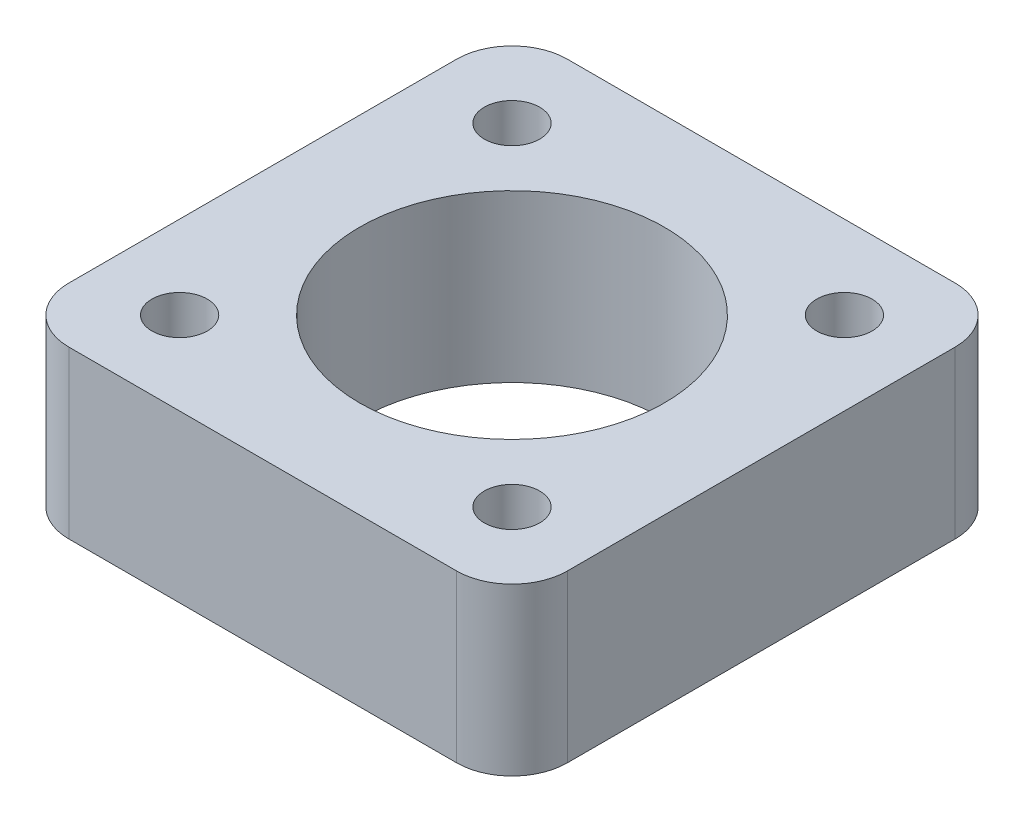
ISO-10303-21;
HEADER;
FILE_DESCRIPTION(('STEP AP214'),'2;1');
FILE_NAME('part.step','',(''),(''),'','','');
FILE_SCHEMA(('AUTOMOTIVE_DESIGN { 1 0 10303 214 1 1 1 1 }'));
ENDSEC;
DATA;
#1=APPLICATION_CONTEXT('core data for automotive mechanical design processes');
#2=APPLICATION_PROTOCOL_DEFINITION('international standard','automotive_design',2000,#1);
#3=PRODUCT_CONTEXT('',#1,'mechanical');
#4=PRODUCT('Part','Part','',(#3));
#5=PRODUCT_RELATED_PRODUCT_CATEGORY('part','',(#4));
#6=PRODUCT_DEFINITION_FORMATION('','',#4);
#7=PRODUCT_DEFINITION_CONTEXT('part definition',#1,'design');
#8=PRODUCT_DEFINITION('design','',#6,#7);
#9=PRODUCT_DEFINITION_SHAPE('','',#8);
#10=(LENGTH_UNIT() NAMED_UNIT(*) SI_UNIT(.MILLI.,.METRE.));
#11=(NAMED_UNIT(*) PLANE_ANGLE_UNIT() SI_UNIT($,.RADIAN.));
#12=(NAMED_UNIT(*) SI_UNIT($,.STERADIAN.) SOLID_ANGLE_UNIT());
#13=UNCERTAINTY_MEASURE_WITH_UNIT(LENGTH_MEASURE(1.E-05),#10,'distance_accuracy_value','');
#14=(GEOMETRIC_REPRESENTATION_CONTEXT(3) GLOBAL_UNCERTAINTY_ASSIGNED_CONTEXT((#13)) GLOBAL_UNIT_ASSIGNED_CONTEXT((#10,
#11,#12)) REPRESENTATION_CONTEXT('',''));
#15=CARTESIAN_POINT('',(0.,0.,0.));
#16=DIRECTION('',(0.,0.,1.));
#17=DIRECTION('',(1.,0.,0.));
#18=AXIS2_PLACEMENT_3D('',#15,#16,#17);
#19=CARTESIAN_POINT('',(0.,12.,0.));
#20=DIRECTION('',(1.,0.,0.));
#21=DIRECTION('',(0.,0.,-1.));
#22=AXIS2_PLACEMENT_3D('',#19,#20,#21);
#23=PLANE('',#22);
#24=DIRECTION('',(0.,0.,1.));
#25=VECTOR('',#24,1.);
#26=CARTESIAN_POINT('',(0.,12.,0.));
#27=LINE('',#26,#25);
#28=CARTESIAN_POINT('',(0.,12.,-32.));
#29=VERTEX_POINT('',#28);
#30=CARTESIAN_POINT('',(0.,12.,-4.));
#31=VERTEX_POINT('',#30);
#32=EDGE_CURVE('E125',#29,#31,#27,.T.);
#33=ORIENTED_EDGE('',*,*,#32,.F.);
#34=DIRECTION('',(0.,-1.,0.));
#35=VECTOR('',#34,1.);
#36=CARTESIAN_POINT('',(0.,12.,-32.));
#37=LINE('',#36,#35);
#38=CARTESIAN_POINT('',(0.,0.,-32.));
#39=VERTEX_POINT('',#38);
#40=EDGE_CURVE('E11',#29,#39,#37,.T.);
#41=ORIENTED_EDGE('',*,*,#40,.T.);
#42=DIRECTION('',(0.,0.,1.));
#43=VECTOR('',#42,1.);
#44=CARTESIAN_POINT('',(0.,0.,0.));
#45=LINE('',#44,#43);
#46=CARTESIAN_POINT('',(0.,0.,-4.));
#47=VERTEX_POINT('',#46);
#48=EDGE_CURVE('E127',#39,#47,#45,.T.);
#49=ORIENTED_EDGE('',*,*,#48,.T.);
#50=DIRECTION('',(0.,-1.,0.));
#51=VECTOR('',#50,1.);
#52=CARTESIAN_POINT('',(0.,12.,-4.));
#53=LINE('',#52,#51);
#54=EDGE_CURVE('E38',#47,#31,#53,.F.);
#55=ORIENTED_EDGE('',*,*,#54,.T.);
#56=EDGE_LOOP('',(#33,#41,#49,#55));
#57=FACE_BOUND('',#56,.T.);
#58=ADVANCED_FACE('F31',(#57),#23,.F.);
#59=CARTESIAN_POINT('',(0.,12.,0.));
#60=DIRECTION('',(0.,0.,-1.));
#61=DIRECTION('',(-1.,0.,0.));
#62=AXIS2_PLACEMENT_3D('',#59,#60,#61);
#63=PLANE('',#62);
#64=DIRECTION('',(1.,0.,0.));
#65=VECTOR('',#64,1.);
#66=CARTESIAN_POINT('',(0.,0.,0.));
#67=LINE('',#66,#65);
#68=CARTESIAN_POINT('',(4.,0.,0.));
#69=VERTEX_POINT('',#68);
#70=CARTESIAN_POINT('',(32.,0.,0.));
#71=VERTEX_POINT('',#70);
#72=EDGE_CURVE('E123',#69,#71,#67,.T.);
#73=ORIENTED_EDGE('',*,*,#72,.T.);
#74=DIRECTION('',(0.,-1.,0.));
#75=VECTOR('',#74,1.);
#76=CARTESIAN_POINT('',(32.,12.,0.));
#77=LINE('',#76,#75);
#78=CARTESIAN_POINT('',(32.,12.,0.));
#79=VERTEX_POINT('',#78);
#80=EDGE_CURVE('E102',#71,#79,#77,.F.);
#81=ORIENTED_EDGE('',*,*,#80,.T.);
#82=DIRECTION('',(1.,0.,0.));
#83=VECTOR('',#82,1.);
#84=CARTESIAN_POINT('',(0.,12.,0.));
#85=LINE('',#84,#83);
#86=CARTESIAN_POINT('',(4.,12.,0.));
#87=VERTEX_POINT('',#86);
#88=EDGE_CURVE('E133',#87,#79,#85,.T.);
#89=ORIENTED_EDGE('',*,*,#88,.F.);
#90=DIRECTION('',(0.,-1.,0.));
#91=VECTOR('',#90,1.);
#92=CARTESIAN_POINT('',(4.,12.,0.));
#93=LINE('',#92,#91);
#94=EDGE_CURVE('E107',#87,#69,#93,.T.);
#95=ORIENTED_EDGE('',*,*,#94,.T.);
#96=EDGE_LOOP('',(#73,#81,#89,#95));
#97=FACE_BOUND('',#96,.T.);
#98=ADVANCED_FACE('F171',(#97),#63,.F.);
#99=CARTESIAN_POINT('',(36.,12.,0.));
#100=DIRECTION('',(-1.,0.,0.));
#101=DIRECTION('',(0.,0.,1.));
#102=AXIS2_PLACEMENT_3D('',#99,#100,#101);
#103=PLANE('',#102);
#104=DIRECTION('',(0.,0.,-1.));
#105=VECTOR('',#104,1.);
#106=CARTESIAN_POINT('',(36.,12.,0.));
#107=LINE('',#106,#105);
#108=CARTESIAN_POINT('',(36.,12.,-4.));
#109=VERTEX_POINT('',#108);
#110=CARTESIAN_POINT('',(36.,12.,-32.));
#111=VERTEX_POINT('',#110);
#112=EDGE_CURVE('E116',#109,#111,#107,.T.);
#113=ORIENTED_EDGE('',*,*,#112,.F.);
#114=DIRECTION('',(0.,-1.,0.));
#115=VECTOR('',#114,1.);
#116=CARTESIAN_POINT('',(36.,12.,-4.));
#117=LINE('',#116,#115);
#118=CARTESIAN_POINT('',(36.,0.,-4.));
#119=VERTEX_POINT('',#118);
#120=EDGE_CURVE('E101',#109,#119,#117,.T.);
#121=ORIENTED_EDGE('',*,*,#120,.T.);
#122=DIRECTION('',(0.,0.,-1.));
#123=VECTOR('',#122,1.);
#124=CARTESIAN_POINT('',(36.,0.,0.));
#125=LINE('',#124,#123);
#126=CARTESIAN_POINT('',(36.,0.,-32.));
#127=VERTEX_POINT('',#126);
#128=EDGE_CURVE('E114',#119,#127,#125,.T.);
#129=ORIENTED_EDGE('',*,*,#128,.T.);
#130=DIRECTION('',(0.,-1.,0.));
#131=VECTOR('',#130,1.);
#132=CARTESIAN_POINT('',(36.,12.,-32.));
#133=LINE('',#132,#131);
#134=EDGE_CURVE('E118',#127,#111,#133,.F.);
#135=ORIENTED_EDGE('',*,*,#134,.T.);
#136=EDGE_LOOP('',(#113,#121,#129,#135));
#137=FACE_BOUND('',#136,.T.);
#138=ADVANCED_FACE('F113',(#137),#103,.F.);
#139=CARTESIAN_POINT('',(0.,12.,-36.));
#140=DIRECTION('',(0.,0.,1.));
#141=DIRECTION('',(1.,0.,0.));
#142=AXIS2_PLACEMENT_3D('',#139,#140,#141);
#143=PLANE('',#142);
#144=DIRECTION('',(-1.,0.,0.));
#145=VECTOR('',#144,1.);
#146=CARTESIAN_POINT('',(0.,12.,-36.));
#147=LINE('',#146,#145);
#148=CARTESIAN_POINT('',(32.,12.,-36.));
#149=VERTEX_POINT('',#148);
#150=CARTESIAN_POINT('',(4.,12.,-36.));
#151=VERTEX_POINT('',#150);
#152=EDGE_CURVE('E137',#149,#151,#147,.T.);
#153=ORIENTED_EDGE('',*,*,#152,.F.);
#154=DIRECTION('',(0.,-1.,0.));
#155=VECTOR('',#154,1.);
#156=CARTESIAN_POINT('',(32.,12.,-36.));
#157=LINE('',#156,#155);
#158=CARTESIAN_POINT('',(32.,0.,-36.));
#159=VERTEX_POINT('',#158);
#160=EDGE_CURVE('E155',#149,#159,#157,.T.);
#161=ORIENTED_EDGE('',*,*,#160,.T.);
#162=DIRECTION('',(-1.,0.,0.));
#163=VECTOR('',#162,1.);
#164=CARTESIAN_POINT('',(0.,0.,-36.));
#165=LINE('',#164,#163);
#166=CARTESIAN_POINT('',(4.,0.,-36.));
#167=VERTEX_POINT('',#166);
#168=EDGE_CURVE('E122',#159,#167,#165,.T.);
#169=ORIENTED_EDGE('',*,*,#168,.T.);
#170=DIRECTION('',(0.,-1.,0.));
#171=VECTOR('',#170,1.);
#172=CARTESIAN_POINT('',(4.,12.,-36.));
#173=LINE('',#172,#171);
#174=EDGE_CURVE('E45',#167,#151,#173,.F.);
#175=ORIENTED_EDGE('',*,*,#174,.T.);
#176=EDGE_LOOP('',(#153,#161,#169,#175));
#177=FACE_BOUND('',#176,.T.);
#178=ADVANCED_FACE('F208',(#177),#143,.F.);
#179=CARTESIAN_POINT('',(0.,12.,-36.));
#180=DIRECTION('',(0.,-1.,0.));
#181=DIRECTION('',(0.,0.,-1.));
#182=AXIS2_PLACEMENT_3D('',#179,#180,#181);
#183=PLANE('',#182);
#184=CARTESIAN_POINT('',(30.,12.,-5.99999999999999));
#185=DIRECTION('',(0.,1.,0.));
#186=DIRECTION('',(0.,0.,1.));
#187=AXIS2_PLACEMENT_3D('',#184,#185,#186);
#188=CIRCLE('',#187,2.);
#189=CARTESIAN_POINT('',(30.,12.,-3.99999999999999));
#190=VERTEX_POINT('',#189);
#191=EDGE_CURVE('E200',#190,#190,#188,.T.);
#192=ORIENTED_EDGE('',*,*,#191,.F.);
#193=EDGE_LOOP('',(#192));
#194=FACE_BOUND('',#193,.T.);
#195=CARTESIAN_POINT('',(30.,12.,-30.));
#196=DIRECTION('',(0.,1.,0.));
#197=DIRECTION('',(0.,0.,1.));
#198=AXIS2_PLACEMENT_3D('',#195,#196,#197);
#199=CIRCLE('',#198,2.);
#200=CARTESIAN_POINT('',(30.,12.,-28.));
#201=VERTEX_POINT('',#200);
#202=EDGE_CURVE('E194',#201,#201,#199,.T.);
#203=ORIENTED_EDGE('',*,*,#202,.F.);
#204=EDGE_LOOP('',(#203));
#205=FACE_BOUND('',#204,.T.);
#206=CARTESIAN_POINT('',(6.,12.,-5.99999999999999));
#207=DIRECTION('',(0.,1.,0.));
#208=DIRECTION('',(0.,0.,1.));
#209=AXIS2_PLACEMENT_3D('',#206,#207,#208);
#210=CIRCLE('',#209,2.);
#211=CARTESIAN_POINT('',(6.,12.,-3.99999999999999));
#212=VERTEX_POINT('',#211);
#213=EDGE_CURVE('E188',#212,#212,#210,.T.);
#214=ORIENTED_EDGE('',*,*,#213,.F.);
#215=EDGE_LOOP('',(#214));
#216=FACE_BOUND('',#215,.T.);
#217=CARTESIAN_POINT('',(6.,12.,-30.));
#218=DIRECTION('',(0.,1.,0.));
#219=DIRECTION('',(0.,0.,1.));
#220=AXIS2_PLACEMENT_3D('',#217,#218,#219);
#221=CIRCLE('',#220,2.);
#222=CARTESIAN_POINT('',(6.,12.,-28.));
#223=VERTEX_POINT('',#222);
#224=EDGE_CURVE('E182',#223,#223,#221,.T.);
#225=ORIENTED_EDGE('',*,*,#224,.F.);
#226=EDGE_LOOP('',(#225));
#227=FACE_BOUND('',#226,.T.);
#228=CARTESIAN_POINT('',(18.,12.,-18.));
#229=DIRECTION('',(0.,1.,0.));
#230=DIRECTION('',(0.,0.,1.));
#231=AXIS2_PLACEMENT_3D('',#228,#229,#230);
#232=CIRCLE('',#231,11.);
#233=CARTESIAN_POINT('',(18.,12.,-7.));
#234=VERTEX_POINT('',#233);
#235=EDGE_CURVE('E174',#234,#234,#232,.T.);
#236=ORIENTED_EDGE('',*,*,#235,.F.);
#237=EDGE_LOOP('',(#236));
#238=FACE_BOUND('',#237,.T.);
#239=ORIENTED_EDGE('',*,*,#88,.T.);
#240=CARTESIAN_POINT('',(32.,12.,-4.));
#241=DIRECTION('',(0.,-1.,0.));
#242=DIRECTION('',(0.,0.,-1.));
#243=AXIS2_PLACEMENT_3D('',#240,#241,#242);
#244=CIRCLE('',#243,4.);
#245=EDGE_CURVE('E152',#79,#109,#244,.F.);
#246=ORIENTED_EDGE('',*,*,#245,.T.);
#247=ORIENTED_EDGE('',*,*,#112,.T.);
#248=CARTESIAN_POINT('',(32.,12.,-32.));
#249=DIRECTION('',(0.,-1.,0.));
#250=DIRECTION('',(0.,0.,-1.));
#251=AXIS2_PLACEMENT_3D('',#248,#249,#250);
#252=CIRCLE('',#251,4.);
#253=EDGE_CURVE('E52',#111,#149,#252,.F.);
#254=ORIENTED_EDGE('',*,*,#253,.T.);
#255=ORIENTED_EDGE('',*,*,#152,.T.);
#256=CARTESIAN_POINT('',(4.,12.,-32.));
#257=DIRECTION('',(0.,-1.,0.));
#258=DIRECTION('',(0.,0.,-1.));
#259=AXIS2_PLACEMENT_3D('',#256,#257,#258);
#260=CIRCLE('',#259,4.);
#261=EDGE_CURVE('E149',#151,#29,#260,.F.);
#262=ORIENTED_EDGE('',*,*,#261,.T.);
#263=ORIENTED_EDGE('',*,*,#32,.T.);
#264=CARTESIAN_POINT('',(4.,12.,-4.));
#265=DIRECTION('',(0.,-1.,0.));
#266=DIRECTION('',(0.,0.,-1.));
#267=AXIS2_PLACEMENT_3D('',#264,#265,#266);
#268=CIRCLE('',#267,4.);
#269=EDGE_CURVE('E147',#31,#87,#268,.F.);
#270=ORIENTED_EDGE('',*,*,#269,.T.);
#271=EDGE_LOOP('',(#239,#246,#247,#254,#255,#262,#263,#270));
#272=FACE_BOUND('',#271,.T.);
#273=ADVANCED_FACE('F165',(#194,#205,#216,#227,#238,#272),#183,.F.);
#274=CARTESIAN_POINT('',(0.,0.,-36.));
#275=DIRECTION('',(0.,-1.,0.));
#276=DIRECTION('',(0.,0.,-1.));
#277=AXIS2_PLACEMENT_3D('',#274,#275,#276);
#278=PLANE('',#277);
#279=CARTESIAN_POINT('',(30.,0.,-5.99999999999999));
#280=DIRECTION('',(0.,1.,0.));
#281=DIRECTION('',(0.,0.,1.));
#282=AXIS2_PLACEMENT_3D('',#279,#280,#281);
#283=CIRCLE('',#282,2.);
#284=CARTESIAN_POINT('',(30.,0.,-3.99999999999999));
#285=VERTEX_POINT('',#284);
#286=EDGE_CURVE('E197',#285,#285,#283,.T.);
#287=ORIENTED_EDGE('',*,*,#286,.T.);
#288=EDGE_LOOP('',(#287));
#289=FACE_BOUND('',#288,.T.);
#290=CARTESIAN_POINT('',(30.,0.,-30.));
#291=DIRECTION('',(0.,1.,0.));
#292=DIRECTION('',(0.,0.,1.));
#293=AXIS2_PLACEMENT_3D('',#290,#291,#292);
#294=CIRCLE('',#293,2.);
#295=CARTESIAN_POINT('',(30.,0.,-28.));
#296=VERTEX_POINT('',#295);
#297=EDGE_CURVE('E191',#296,#296,#294,.T.);
#298=ORIENTED_EDGE('',*,*,#297,.T.);
#299=EDGE_LOOP('',(#298));
#300=FACE_BOUND('',#299,.T.);
#301=CARTESIAN_POINT('',(6.,0.,-5.99999999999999));
#302=DIRECTION('',(0.,1.,0.));
#303=DIRECTION('',(0.,0.,1.));
#304=AXIS2_PLACEMENT_3D('',#301,#302,#303);
#305=CIRCLE('',#304,2.);
#306=CARTESIAN_POINT('',(6.,0.,-3.99999999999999));
#307=VERTEX_POINT('',#306);
#308=EDGE_CURVE('E185',#307,#307,#305,.T.);
#309=ORIENTED_EDGE('',*,*,#308,.T.);
#310=EDGE_LOOP('',(#309));
#311=FACE_BOUND('',#310,.T.);
#312=CARTESIAN_POINT('',(6.,0.,-30.));
#313=DIRECTION('',(0.,1.,0.));
#314=DIRECTION('',(0.,0.,1.));
#315=AXIS2_PLACEMENT_3D('',#312,#313,#314);
#316=CIRCLE('',#315,2.);
#317=CARTESIAN_POINT('',(6.,0.,-28.));
#318=VERTEX_POINT('',#317);
#319=EDGE_CURVE('E179',#318,#318,#316,.T.);
#320=ORIENTED_EDGE('',*,*,#319,.T.);
#321=EDGE_LOOP('',(#320));
#322=FACE_BOUND('',#321,.T.);
#323=CARTESIAN_POINT('',(18.,0.,-18.));
#324=DIRECTION('',(0.,1.,0.));
#325=DIRECTION('',(0.,0.,1.));
#326=AXIS2_PLACEMENT_3D('',#323,#324,#325);
#327=CIRCLE('',#326,11.);
#328=CARTESIAN_POINT('',(18.,0.,-7.));
#329=VERTEX_POINT('',#328);
#330=EDGE_CURVE('E172',#329,#329,#327,.T.);
#331=ORIENTED_EDGE('',*,*,#330,.T.);
#332=EDGE_LOOP('',(#331));
#333=FACE_BOUND('',#332,.T.);
#334=ORIENTED_EDGE('',*,*,#128,.F.);
#335=CARTESIAN_POINT('',(32.,0.,-4.));
#336=DIRECTION('',(0.,-1.,0.));
#337=DIRECTION('',(0.,0.,-1.));
#338=AXIS2_PLACEMENT_3D('',#335,#336,#337);
#339=CIRCLE('',#338,4.);
#340=EDGE_CURVE('E97',#119,#71,#339,.T.);
#341=ORIENTED_EDGE('',*,*,#340,.T.);
#342=ORIENTED_EDGE('',*,*,#72,.F.);
#343=CARTESIAN_POINT('',(4.,0.,-4.));
#344=DIRECTION('',(0.,-1.,0.));
#345=DIRECTION('',(0.,0.,-1.));
#346=AXIS2_PLACEMENT_3D('',#343,#344,#345);
#347=CIRCLE('',#346,4.);
#348=EDGE_CURVE('E117',#69,#47,#347,.T.);
#349=ORIENTED_EDGE('',*,*,#348,.T.);
#350=ORIENTED_EDGE('',*,*,#48,.F.);
#351=CARTESIAN_POINT('',(4.,0.,-32.));
#352=DIRECTION('',(0.,-1.,0.));
#353=DIRECTION('',(0.,0.,-1.));
#354=AXIS2_PLACEMENT_3D('',#351,#352,#353);
#355=CIRCLE('',#354,4.);
#356=EDGE_CURVE('E141',#39,#167,#355,.T.);
#357=ORIENTED_EDGE('',*,*,#356,.T.);
#358=ORIENTED_EDGE('',*,*,#168,.F.);
#359=CARTESIAN_POINT('',(32.,0.,-32.));
#360=DIRECTION('',(0.,-1.,0.));
#361=DIRECTION('',(0.,0.,-1.));
#362=AXIS2_PLACEMENT_3D('',#359,#360,#361);
#363=CIRCLE('',#362,4.);
#364=EDGE_CURVE('E108',#159,#127,#363,.T.);
#365=ORIENTED_EDGE('',*,*,#364,.T.);
#366=EDGE_LOOP('',(#334,#341,#342,#349,#350,#357,#358,#365));
#367=FACE_BOUND('',#366,.T.);
#368=ADVANCED_FACE('F120',(#289,#300,#311,#322,#333,#367),#278,.T.);
#369=CARTESIAN_POINT('',(18.,0.,-18.));
#370=DIRECTION('',(0.,1.,0.));
#371=DIRECTION('',(0.,0.,1.));
#372=AXIS2_PLACEMENT_3D('',#369,#370,#371);
#373=CYLINDRICAL_SURFACE('',#372,11.);
#374=ORIENTED_EDGE('',*,*,#330,.F.);
#375=EDGE_LOOP('',(#374));
#376=FACE_BOUND('',#375,.T.);
#377=ORIENTED_EDGE('',*,*,#235,.T.);
#378=EDGE_LOOP('',(#377));
#379=FACE_BOUND('',#378,.T.);
#380=ADVANCED_FACE('F218',(#376,#379),#373,.F.);
#381=CARTESIAN_POINT('',(6.,0.,-30.));
#382=DIRECTION('',(0.,1.,0.));
#383=DIRECTION('',(0.,0.,1.));
#384=AXIS2_PLACEMENT_3D('',#381,#382,#383);
#385=CYLINDRICAL_SURFACE('',#384,2.);
#386=ORIENTED_EDGE('',*,*,#319,.F.);
#387=EDGE_LOOP('',(#386));
#388=FACE_BOUND('',#387,.T.);
#389=ORIENTED_EDGE('',*,*,#224,.T.);
#390=EDGE_LOOP('',(#389));
#391=FACE_BOUND('',#390,.T.);
#392=ADVANCED_FACE('F220',(#388,#391),#385,.F.);
#393=CARTESIAN_POINT('',(6.,0.,-5.99999999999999));
#394=DIRECTION('',(0.,1.,0.));
#395=DIRECTION('',(0.,0.,1.));
#396=AXIS2_PLACEMENT_3D('',#393,#394,#395);
#397=CYLINDRICAL_SURFACE('',#396,2.);
#398=ORIENTED_EDGE('',*,*,#308,.F.);
#399=EDGE_LOOP('',(#398));
#400=FACE_BOUND('',#399,.T.);
#401=ORIENTED_EDGE('',*,*,#213,.T.);
#402=EDGE_LOOP('',(#401));
#403=FACE_BOUND('',#402,.T.);
#404=ADVANCED_FACE('F227',(#400,#403),#397,.F.);
#405=CARTESIAN_POINT('',(30.,0.,-30.));
#406=DIRECTION('',(0.,1.,0.));
#407=DIRECTION('',(0.,0.,1.));
#408=AXIS2_PLACEMENT_3D('',#405,#406,#407);
#409=CYLINDRICAL_SURFACE('',#408,2.);
#410=ORIENTED_EDGE('',*,*,#297,.F.);
#411=EDGE_LOOP('',(#410));
#412=FACE_BOUND('',#411,.T.);
#413=ORIENTED_EDGE('',*,*,#202,.T.);
#414=EDGE_LOOP('',(#413));
#415=FACE_BOUND('',#414,.T.);
#416=ADVANCED_FACE('F262',(#412,#415),#409,.F.);
#417=CARTESIAN_POINT('',(30.,0.,-5.99999999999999));
#418=DIRECTION('',(0.,1.,0.));
#419=DIRECTION('',(0.,0.,1.));
#420=AXIS2_PLACEMENT_3D('',#417,#418,#419);
#421=CYLINDRICAL_SURFACE('',#420,2.);
#422=ORIENTED_EDGE('',*,*,#286,.F.);
#423=EDGE_LOOP('',(#422));
#424=FACE_BOUND('',#423,.T.);
#425=ORIENTED_EDGE('',*,*,#191,.T.);
#426=EDGE_LOOP('',(#425));
#427=FACE_BOUND('',#426,.T.);
#428=ADVANCED_FACE('F204',(#424,#427),#421,.F.);
#429=CARTESIAN_POINT('',(32.,12.,-4.));
#430=DIRECTION('',(0.,-1.,0.));
#431=DIRECTION('',(0.,0.,-1.));
#432=AXIS2_PLACEMENT_3D('',#429,#430,#431);
#433=CYLINDRICAL_SURFACE('',#432,4.);
#434=ORIENTED_EDGE('',*,*,#245,.F.);
#435=ORIENTED_EDGE('',*,*,#80,.F.);
#436=ORIENTED_EDGE('',*,*,#340,.F.);
#437=ORIENTED_EDGE('',*,*,#120,.F.);
#438=EDGE_LOOP('',(#434,#435,#436,#437));
#439=FACE_BOUND('',#438,.T.);
#440=ADVANCED_FACE('F100',(#439),#433,.T.);
#441=CARTESIAN_POINT('',(32.,12.,-32.));
#442=DIRECTION('',(0.,-1.,0.));
#443=DIRECTION('',(0.,0.,-1.));
#444=AXIS2_PLACEMENT_3D('',#441,#442,#443);
#445=CYLINDRICAL_SURFACE('',#444,4.);
#446=ORIENTED_EDGE('',*,*,#253,.F.);
#447=ORIENTED_EDGE('',*,*,#134,.F.);
#448=ORIENTED_EDGE('',*,*,#364,.F.);
#449=ORIENTED_EDGE('',*,*,#160,.F.);
#450=EDGE_LOOP('',(#446,#447,#448,#449));
#451=FACE_BOUND('',#450,.T.);
#452=ADVANCED_FACE('F247',(#451),#445,.T.);
#453=CARTESIAN_POINT('',(4.,12.,-32.));
#454=DIRECTION('',(0.,-1.,0.));
#455=DIRECTION('',(0.,0.,-1.));
#456=AXIS2_PLACEMENT_3D('',#453,#454,#455);
#457=CYLINDRICAL_SURFACE('',#456,4.);
#458=ORIENTED_EDGE('',*,*,#261,.F.);
#459=ORIENTED_EDGE('',*,*,#174,.F.);
#460=ORIENTED_EDGE('',*,*,#356,.F.);
#461=ORIENTED_EDGE('',*,*,#40,.F.);
#462=EDGE_LOOP('',(#458,#459,#460,#461));
#463=FACE_BOUND('',#462,.T.);
#464=ADVANCED_FACE('F249',(#463),#457,.T.);
#465=CARTESIAN_POINT('',(4.,12.,-4.));
#466=DIRECTION('',(0.,-1.,0.));
#467=DIRECTION('',(0.,0.,-1.));
#468=AXIS2_PLACEMENT_3D('',#465,#466,#467);
#469=CYLINDRICAL_SURFACE('',#468,4.);
#470=ORIENTED_EDGE('',*,*,#269,.F.);
#471=ORIENTED_EDGE('',*,*,#54,.F.);
#472=ORIENTED_EDGE('',*,*,#348,.F.);
#473=ORIENTED_EDGE('',*,*,#94,.F.);
#474=EDGE_LOOP('',(#470,#471,#472,#473));
#475=FACE_BOUND('',#474,.T.);
#476=ADVANCED_FACE('F169',(#475),#469,.T.);
#477=CLOSED_SHELL('',(#58,#98,#138,#178,#273,#368,#380,#392,#404,#416,#428,#440,#452,#464,#476));
#478=MANIFOLD_SOLID_BREP('B2',#477);
#479=ADVANCED_BREP_SHAPE_REPRESENTATION('',(#18,#478),#14);
#480=SHAPE_DEFINITION_REPRESENTATION(#9,#479);
ENDSEC;
END-ISO-10303-21;
